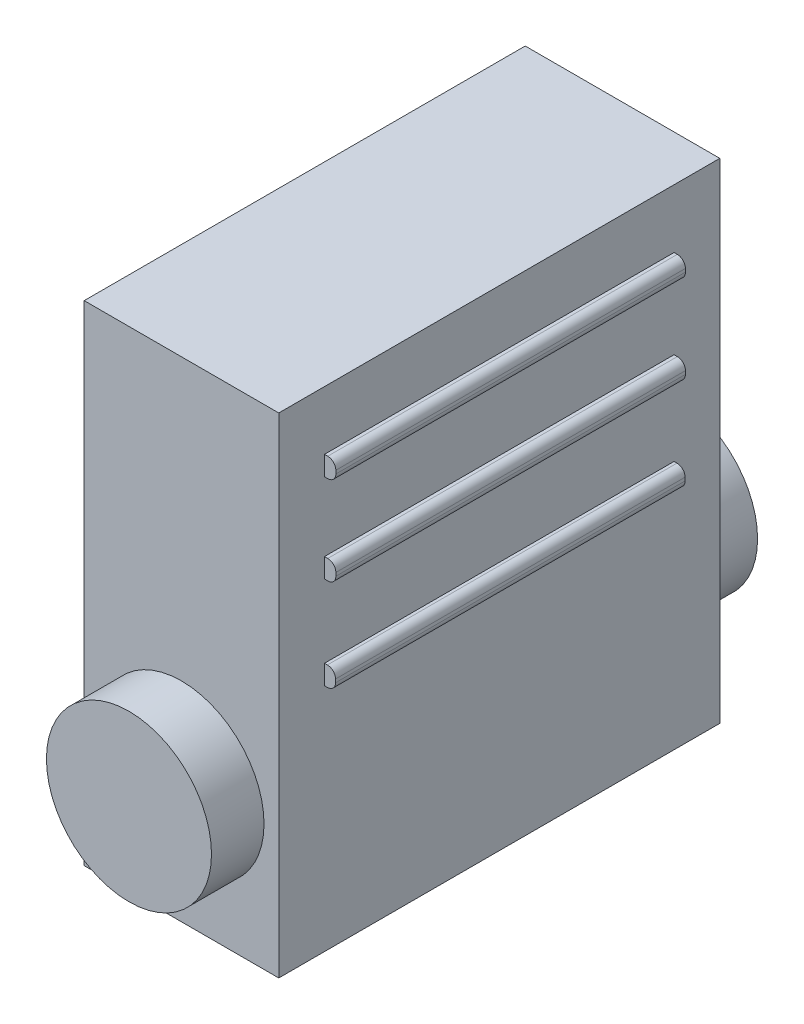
from build123d import *

# Parameters (mm, degrees)
SKETCH1_W           = 15.24
SKETCH1_H           = 38.3286
BOSS_EXTRUDE1_DEPTH = 34.544
SKETCH2_R           = 6.4643
BOSS_EXTRUDE2_DEPTH = 4.1148
BOSS_EXTRUDE3_START = 4.1148
SKETCH3_R           = 6.4643
BOSS_EXTRUDE3_DEPTH = 4.1148
SKETCH7_W           = 27.3812
SKETCH7_H           = 1.524
BOSS_EXTRUDE4_DEPTH = 0.8636
FILLET1_R           = 0.635
FILLET2_R           = 0.635
SKETCH8_W           = 27.3812
SKETCH8_H           = 1.524
BOSS_EXTRUDE5_DEPTH = 0.889
SKETCH9_W           = 27.3812
SKETCH9_H           = 1.524
BOSS_EXTRUDE6_DEPTH = 0.889
FILLET3_R           = 0.635
FILLET4_R           = 0.635
SKETCH10_W          = 27.3812
SKETCH10_H          = 1.524
BOSS_EXTRUDE7_DEPTH = 0.889
FILLET6_R           = 0.635
SKETCH12_W          = 27.3812
SKETCH12_H          = 1.524
BOSS_EXTRUDE8_DEPTH = 0.889
FILLET7_R           = 0.635


with BuildPart() as part:
    # Sketch1 → Boss-Extrude1 (new body)
    with BuildSketch(Plane.XY):
        Rectangle(SKETCH1_W, SKETCH1_H)
    extrude(amount=BOSS_EXTRUDE1_DEPTH)

    # Sketch2 → Boss-Extrude2 (add)
    with BuildSketch(Plane(origin=(0, 0, 0), x_dir=(-1, 0, 0), z_dir=(0, 0, -1))):
        with Locations(Location((0, -9.2837, 0), (0, 0, 180))):
            Circle(SKETCH2_R)
    extrude(amount=BOSS_EXTRUDE2_DEPTH)

    # Sketch3 → Boss-Extrude3 (add)
    with BuildSketch(Plane.XY.offset(34.544).offset(BOSS_EXTRUDE3_START)):
        with Locations((0, -9.2837)):
            Circle(SKETCH3_R)
    extrude(amount=-BOSS_EXTRUDE3_DEPTH)

    # Sketch7 → Boss-Extrude4 (add)
    with BuildSketch(Plane(origin=(7.62, 0, 0), x_dir=(0, 0, -1), z_dir=(1, 0, 0))):
        with Locations((-17.272, -0.3683)):
            Rectangle(SKETCH7_W, SKETCH7_H)
    extrude(amount=BOSS_EXTRUDE4_DEPTH)

    # Fillet1
    fillet1_edges = [part.edges().sort_by_distance(p)[0] for p in [
        (8.4836, 0.3937, 17.272),
    ]]
    fillet(fillet1_edges, radius=FILLET1_R)

    # Fillet2
    fillet2_edges = [part.edges().sort_by_distance(p)[0] for p in [
        (8.4836, -1.1303, 17.272),
    ]]
    fillet(fillet2_edges, radius=FILLET2_R)

    # Sketch8 → Boss-Extrude5 (add)
    with BuildSketch(Plane(origin=(7.62, 0, 0), x_dir=(0, 0, -1), z_dir=(1, 0, 0))):
        with Locations((-17.272, 6.8707)):
            Rectangle(SKETCH8_W, SKETCH8_H)
    extrude(amount=BOSS_EXTRUDE5_DEPTH)

    # Sketch9 → Boss-Extrude6 (add)
    with BuildSketch(Plane(origin=(7.62, 0, 0), x_dir=(0, 0, -1), z_dir=(1, 0, 0))):
        with Locations((-17.272, 13.8049)):
            Rectangle(SKETCH9_W, SKETCH9_H)
    extrude(amount=BOSS_EXTRUDE6_DEPTH)

    # Fillet3
    fillet3_edges = [part.edges().sort_by_distance(p)[0] for p in [
        (8.509, 14.5669, 17.272),
        (8.509, 13.0429, 17.272),
    ]]
    fillet(fillet3_edges, radius=FILLET3_R)

    # Fillet4
    fillet4_edges = [part.edges().sort_by_distance(p)[0] for p in [
        (8.509, 7.6327, 17.272),
        (8.509, 6.1087, 17.272),
    ]]
    fillet(fillet4_edges, radius=FILLET4_R)

    # Sketch10 → Boss-Extrude7 (add)
    with BuildSketch(Plane.ZY.offset(7.62)):
        with Locations((17.272, -0.3683)):
            Rectangle(SKETCH10_W, SKETCH10_H)
    extrude(amount=BOSS_EXTRUDE7_DEPTH)

    # Fillet6
    fillet6_edges = [part.edges().sort_by_distance(p)[0] for p in [
        (-8.509, 0.3937, 17.272),
        (-8.509, -1.1303, 17.272),
    ]]
    fillet(fillet6_edges, radius=FILLET6_R)

    # Sketch12 → Boss-Extrude8 (add)
    with BuildSketch(Plane.ZY.offset(7.62)):
        with Locations((17.272, 13.3477)):
            Rectangle(SKETCH12_W, SKETCH12_H)
    extrude(amount=BOSS_EXTRUDE8_DEPTH)

    # Fillet7
    fillet7_edges = [part.edges().sort_by_distance(p)[0] for p in [
        (-8.509, 14.1097, 17.272),
        (-8.509, 12.5857, 17.272),
    ]]
    fillet(fillet7_edges, radius=FILLET7_R)


solid = part.part
